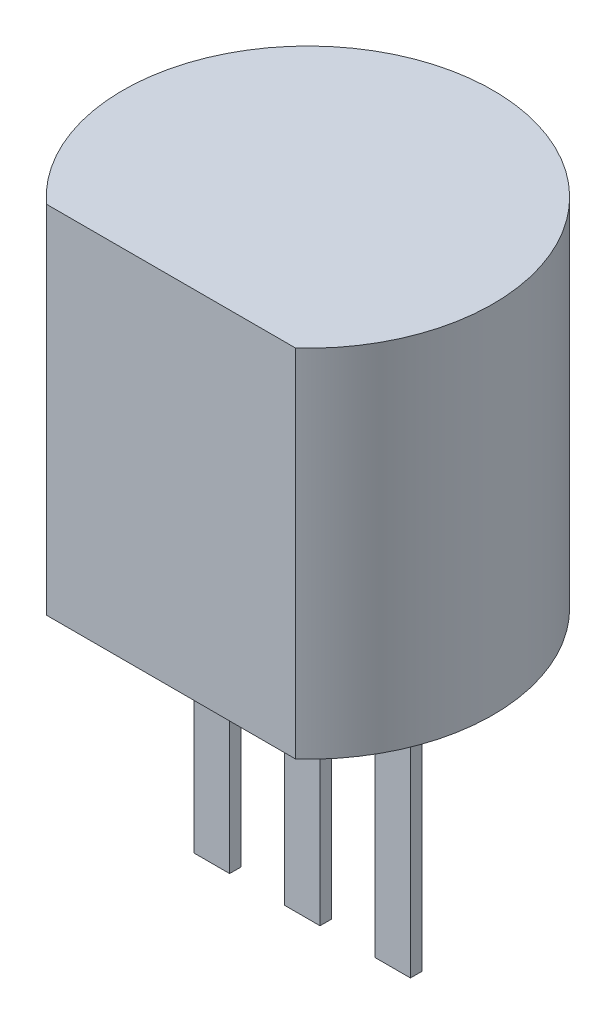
ISO-10303-21;
HEADER;
FILE_DESCRIPTION(('STEP AP214'),'2;1');
FILE_NAME('part.step','',(''),(''),'','','');
FILE_SCHEMA(('AUTOMOTIVE_DESIGN { 1 0 10303 214 1 1 1 1 }'));
ENDSEC;
DATA;
#1=APPLICATION_CONTEXT('core data for automotive mechanical design processes');
#2=APPLICATION_PROTOCOL_DEFINITION('international standard','automotive_design',2000,#1);
#3=PRODUCT_CONTEXT('',#1,'mechanical');
#4=PRODUCT('Part','Part','',(#3));
#5=PRODUCT_RELATED_PRODUCT_CATEGORY('part','',(#4));
#6=PRODUCT_DEFINITION_FORMATION('','',#4);
#7=PRODUCT_DEFINITION_CONTEXT('part definition',#1,'design');
#8=PRODUCT_DEFINITION('design','',#6,#7);
#9=PRODUCT_DEFINITION_SHAPE('','',#8);
#10=(LENGTH_UNIT() NAMED_UNIT(*) SI_UNIT(.MILLI.,.METRE.));
#11=(NAMED_UNIT(*) PLANE_ANGLE_UNIT() SI_UNIT($,.RADIAN.));
#12=(NAMED_UNIT(*) SI_UNIT($,.STERADIAN.) SOLID_ANGLE_UNIT());
#13=UNCERTAINTY_MEASURE_WITH_UNIT(LENGTH_MEASURE(1.E-05),#10,'distance_accuracy_value','');
#14=(GEOMETRIC_REPRESENTATION_CONTEXT(3) GLOBAL_UNCERTAINTY_ASSIGNED_CONTEXT((#13)) GLOBAL_UNIT_ASSIGNED_CONTEXT((#10,
#11,#12)) REPRESENTATION_CONTEXT('',''));
#15=CARTESIAN_POINT('',(0.,0.,0.));
#16=DIRECTION('',(0.,0.,1.));
#17=DIRECTION('',(1.,0.,0.));
#18=AXIS2_PLACEMENT_3D('',#15,#16,#17);
#19=CARTESIAN_POINT('',(0.,1.5,0.));
#20=DIRECTION('',(0.,1.,0.));
#21=DIRECTION('',(0.,0.,1.));
#22=AXIS2_PLACEMENT_3D('',#19,#20,#21);
#23=PLANE('',#22);
#24=DIRECTION('',(0.,0.,1.));
#25=VECTOR('',#24,1.);
#26=CARTESIAN_POINT('',(0.25,1.5,-0.0799999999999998));
#27=LINE('',#26,#25);
#28=CARTESIAN_POINT('',(0.25,1.5,-0.0799999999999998));
#29=VERTEX_POINT('',#28);
#30=CARTESIAN_POINT('',(0.25,1.5,0.08));
#31=VERTEX_POINT('',#30);
#32=EDGE_CURVE('E153',#29,#31,#27,.T.);
#33=ORIENTED_EDGE('',*,*,#32,.F.);
#34=DIRECTION('',(1.,0.,0.));
#35=VECTOR('',#34,1.);
#36=CARTESIAN_POINT('',(-0.25,1.5,-0.0799999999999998));
#37=LINE('',#36,#35);
#38=CARTESIAN_POINT('',(-0.25,1.5,-0.0799999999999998));
#39=VERTEX_POINT('',#38);
#40=EDGE_CURVE('E166',#39,#29,#37,.T.);
#41=ORIENTED_EDGE('',*,*,#40,.F.);
#42=DIRECTION('',(0.,0.,-1.));
#43=VECTOR('',#42,1.);
#44=CARTESIAN_POINT('',(-0.25,1.5,-0.0799999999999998));
#45=LINE('',#44,#43);
#46=CARTESIAN_POINT('',(-0.25,1.5,0.08));
#47=VERTEX_POINT('',#46);
#48=EDGE_CURVE('E175',#47,#39,#45,.T.);
#49=ORIENTED_EDGE('',*,*,#48,.F.);
#50=DIRECTION('',(-1.,0.,0.));
#51=VECTOR('',#50,1.);
#52=CARTESIAN_POINT('',(-0.25,1.5,0.08));
#53=LINE('',#52,#51);
#54=EDGE_CURVE('E156',#31,#47,#53,.T.);
#55=ORIENTED_EDGE('',*,*,#54,.F.);
#56=EDGE_LOOP('',(#33,#41,#49,#55));
#57=FACE_BOUND('',#56,.T.);
#58=CARTESIAN_POINT('',(0.,1.5,0.));
#59=DIRECTION('',(0.,1.,0.));
#60=DIRECTION('',(0.,0.,1.));
#61=AXIS2_PLACEMENT_3D('',#58,#59,#60);
#62=CIRCLE('',#61,2.6);
#63=CARTESIAN_POINT('',(1.75,1.5,1.92288845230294));
#64=VERTEX_POINT('',#63);
#65=CARTESIAN_POINT('',(-1.75,1.5,1.92288845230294));
#66=VERTEX_POINT('',#65);
#67=EDGE_CURVE('E224',#64,#66,#62,.T.);
#68=ORIENTED_EDGE('',*,*,#67,.F.);
#69=DIRECTION('',(1.,0.,0.));
#70=VECTOR('',#69,1.);
#71=CARTESIAN_POINT('',(-1.75,1.5,1.92288845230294));
#72=LINE('',#71,#70);
#73=EDGE_CURVE('E229',#66,#64,#72,.T.);
#74=ORIENTED_EDGE('',*,*,#73,.F.);
#75=EDGE_LOOP('',(#68,#74));
#76=FACE_BOUND('',#75,.T.);
#77=DIRECTION('',(0.,0.,1.));
#78=VECTOR('',#77,1.);
#79=CARTESIAN_POINT('',(-1.02,1.5,-0.08));
#80=LINE('',#79,#78);
#81=CARTESIAN_POINT('',(-1.02,1.5,-0.08));
#82=VERTEX_POINT('',#81);
#83=CARTESIAN_POINT('',(-1.02,1.5,0.08));
#84=VERTEX_POINT('',#83);
#85=EDGE_CURVE('E191',#82,#84,#80,.T.);
#86=ORIENTED_EDGE('',*,*,#85,.F.);
#87=DIRECTION('',(1.,0.,0.));
#88=VECTOR('',#87,1.);
#89=CARTESIAN_POINT('',(-1.52,1.5,-0.08));
#90=LINE('',#89,#88);
#91=CARTESIAN_POINT('',(-1.52,1.5,-0.08));
#92=VERTEX_POINT('',#91);
#93=EDGE_CURVE('E196',#92,#82,#90,.T.);
#94=ORIENTED_EDGE('',*,*,#93,.F.);
#95=DIRECTION('',(0.,0.,-1.));
#96=VECTOR('',#95,1.);
#97=CARTESIAN_POINT('',(-1.52,1.5,-0.08));
#98=LINE('',#97,#96);
#99=CARTESIAN_POINT('',(-1.52,1.5,0.08));
#100=VERTEX_POINT('',#99);
#101=EDGE_CURVE('E208',#100,#92,#98,.T.);
#102=ORIENTED_EDGE('',*,*,#101,.F.);
#103=DIRECTION('',(-1.,0.,0.));
#104=VECTOR('',#103,1.);
#105=CARTESIAN_POINT('',(-1.52,1.5,0.08));
#106=LINE('',#105,#104);
#107=EDGE_CURVE('E205',#84,#100,#106,.T.);
#108=ORIENTED_EDGE('',*,*,#107,.F.);
#109=EDGE_LOOP('',(#86,#94,#102,#108));
#110=FACE_BOUND('',#109,.T.);
#111=DIRECTION('',(0.,0.,1.));
#112=VECTOR('',#111,1.);
#113=CARTESIAN_POINT('',(1.52,1.5,-0.08));
#114=LINE('',#113,#112);
#115=CARTESIAN_POINT('',(1.52,1.5,-0.08));
#116=VERTEX_POINT('',#115);
#117=CARTESIAN_POINT('',(1.52,1.5,0.08));
#118=VERTEX_POINT('',#117);
#119=EDGE_CURVE('E152',#116,#118,#114,.T.);
#120=ORIENTED_EDGE('',*,*,#119,.F.);
#121=DIRECTION('',(1.,0.,0.));
#122=VECTOR('',#121,1.);
#123=CARTESIAN_POINT('',(1.02,1.5,-0.08));
#124=LINE('',#123,#122);
#125=CARTESIAN_POINT('',(1.02,1.5,-0.08));
#126=VERTEX_POINT('',#125);
#127=EDGE_CURVE('E149',#126,#116,#124,.T.);
#128=ORIENTED_EDGE('',*,*,#127,.F.);
#129=DIRECTION('',(0.,0.,-1.));
#130=VECTOR('',#129,1.);
#131=CARTESIAN_POINT('',(1.02,1.5,-0.08));
#132=LINE('',#131,#130);
#133=CARTESIAN_POINT('',(1.02,1.5,0.08));
#134=VERTEX_POINT('',#133);
#135=EDGE_CURVE('E51',#134,#126,#132,.T.);
#136=ORIENTED_EDGE('',*,*,#135,.F.);
#137=DIRECTION('',(-1.,0.,0.));
#138=VECTOR('',#137,1.);
#139=CARTESIAN_POINT('',(1.02,1.5,0.08));
#140=LINE('',#139,#138);
#141=EDGE_CURVE('E46',#118,#134,#140,.T.);
#142=ORIENTED_EDGE('',*,*,#141,.F.);
#143=EDGE_LOOP('',(#120,#128,#136,#142));
#144=FACE_BOUND('',#143,.T.);
#145=ADVANCED_FACE('F31',(#57,#76,#110,#144),#23,.F.);
#146=CARTESIAN_POINT('',(0.,6.5,0.));
#147=DIRECTION('',(0.,-1.,0.));
#148=DIRECTION('',(0.,0.,-1.));
#149=AXIS2_PLACEMENT_3D('',#146,#147,#148);
#150=CYLINDRICAL_SURFACE('',#149,2.6);
#151=ORIENTED_EDGE('',*,*,#67,.T.);
#152=DIRECTION('',(0.,-1.,0.));
#153=VECTOR('',#152,1.);
#154=CARTESIAN_POINT('',(-1.75,6.5,1.92288845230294));
#155=LINE('',#154,#153);
#156=CARTESIAN_POINT('',(-1.75,6.5,1.92288845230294));
#157=VERTEX_POINT('',#156);
#158=EDGE_CURVE('E11',#157,#66,#155,.T.);
#159=ORIENTED_EDGE('',*,*,#158,.F.);
#160=CARTESIAN_POINT('',(0.,6.5,0.));
#161=DIRECTION('',(0.,1.,0.));
#162=DIRECTION('',(0.,0.,1.));
#163=AXIS2_PLACEMENT_3D('',#160,#161,#162);
#164=CIRCLE('',#163,2.6);
#165=CARTESIAN_POINT('',(1.75,6.5,1.92288845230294));
#166=VERTEX_POINT('',#165);
#167=EDGE_CURVE('E225',#166,#157,#164,.T.);
#168=ORIENTED_EDGE('',*,*,#167,.F.);
#169=DIRECTION('',(0.,-1.,0.));
#170=VECTOR('',#169,1.);
#171=CARTESIAN_POINT('',(1.75,6.5,1.92288845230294));
#172=LINE('',#171,#170);
#173=EDGE_CURVE('E39',#166,#64,#172,.T.);
#174=ORIENTED_EDGE('',*,*,#173,.T.);
#175=EDGE_LOOP('',(#151,#159,#168,#174));
#176=FACE_BOUND('',#175,.T.);
#177=ADVANCED_FACE('F33',(#176),#150,.T.);
#178=CARTESIAN_POINT('',(-1.75,6.5,1.92288845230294));
#179=DIRECTION('',(0.,0.,-1.));
#180=DIRECTION('',(-1.,0.,0.));
#181=AXIS2_PLACEMENT_3D('',#178,#179,#180);
#182=PLANE('',#181);
#183=ORIENTED_EDGE('',*,*,#73,.T.);
#184=ORIENTED_EDGE('',*,*,#173,.F.);
#185=DIRECTION('',(1.,0.,0.));
#186=VECTOR('',#185,1.);
#187=CARTESIAN_POINT('',(-1.75,6.5,1.92288845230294));
#188=LINE('',#187,#186);
#189=EDGE_CURVE('E228',#157,#166,#188,.T.);
#190=ORIENTED_EDGE('',*,*,#189,.F.);
#191=ORIENTED_EDGE('',*,*,#158,.T.);
#192=EDGE_LOOP('',(#183,#184,#190,#191));
#193=FACE_BOUND('',#192,.T.);
#194=ADVANCED_FACE('F242',(#193),#182,.F.);
#195=CARTESIAN_POINT('',(0.,6.5,0.));
#196=DIRECTION('',(0.,1.,0.));
#197=DIRECTION('',(0.,0.,1.));
#198=AXIS2_PLACEMENT_3D('',#195,#196,#197);
#199=PLANE('',#198);
#200=ORIENTED_EDGE('',*,*,#167,.T.);
#201=ORIENTED_EDGE('',*,*,#189,.T.);
#202=EDGE_LOOP('',(#200,#201));
#203=FACE_BOUND('',#202,.T.);
#204=ADVANCED_FACE('F244',(#203),#199,.T.);
#205=CARTESIAN_POINT('',(-1.02,-2.2,-0.08));
#206=DIRECTION('',(-1.,0.,0.));
#207=DIRECTION('',(0.,0.,1.));
#208=AXIS2_PLACEMENT_3D('',#205,#206,#207);
#209=PLANE('',#208);
#210=ORIENTED_EDGE('',*,*,#85,.T.);
#211=DIRECTION('',(0.,1.,0.));
#212=VECTOR('',#211,1.);
#213=CARTESIAN_POINT('',(-1.02,-2.2,0.08));
#214=LINE('',#213,#212);
#215=CARTESIAN_POINT('',(-1.02,-2.2,0.08));
#216=VERTEX_POINT('',#215);
#217=EDGE_CURVE('E221',#216,#84,#214,.T.);
#218=ORIENTED_EDGE('',*,*,#217,.F.);
#219=DIRECTION('',(0.,0.,1.));
#220=VECTOR('',#219,1.);
#221=CARTESIAN_POINT('',(-1.02,-2.2,-0.08));
#222=LINE('',#221,#220);
#223=CARTESIAN_POINT('',(-1.02,-2.2,-0.08));
#224=VERTEX_POINT('',#223);
#225=EDGE_CURVE('E192',#224,#216,#222,.T.);
#226=ORIENTED_EDGE('',*,*,#225,.F.);
#227=DIRECTION('',(0.,1.,0.));
#228=VECTOR('',#227,1.);
#229=CARTESIAN_POINT('',(-1.02,-2.2,-0.08));
#230=LINE('',#229,#228);
#231=EDGE_CURVE('E202',#224,#82,#230,.T.);
#232=ORIENTED_EDGE('',*,*,#231,.T.);
#233=EDGE_LOOP('',(#210,#218,#226,#232));
#234=FACE_BOUND('',#233,.T.);
#235=ADVANCED_FACE('F246',(#234),#209,.F.);
#236=CARTESIAN_POINT('',(-1.52,-2.2,0.08));
#237=DIRECTION('',(0.,0.,-1.));
#238=DIRECTION('',(-1.,0.,0.));
#239=AXIS2_PLACEMENT_3D('',#236,#237,#238);
#240=PLANE('',#239);
#241=ORIENTED_EDGE('',*,*,#107,.T.);
#242=DIRECTION('',(0.,1.,0.));
#243=VECTOR('',#242,1.);
#244=CARTESIAN_POINT('',(-1.52,-2.2,0.08));
#245=LINE('',#244,#243);
#246=CARTESIAN_POINT('',(-1.52,-2.2,0.08));
#247=VERTEX_POINT('',#246);
#248=EDGE_CURVE('E218',#247,#100,#245,.T.);
#249=ORIENTED_EDGE('',*,*,#248,.F.);
#250=DIRECTION('',(-1.,0.,0.));
#251=VECTOR('',#250,1.);
#252=CARTESIAN_POINT('',(-1.52,-2.2,0.08));
#253=LINE('',#252,#251);
#254=EDGE_CURVE('E195',#216,#247,#253,.T.);
#255=ORIENTED_EDGE('',*,*,#254,.F.);
#256=ORIENTED_EDGE('',*,*,#217,.T.);
#257=EDGE_LOOP('',(#241,#249,#255,#256));
#258=FACE_BOUND('',#257,.T.);
#259=ADVANCED_FACE('F252',(#258),#240,.F.);
#260=CARTESIAN_POINT('',(-1.52,-2.2,-0.08));
#261=DIRECTION('',(1.,0.,0.));
#262=DIRECTION('',(0.,0.,-1.));
#263=AXIS2_PLACEMENT_3D('',#260,#261,#262);
#264=PLANE('',#263);
#265=ORIENTED_EDGE('',*,*,#101,.T.);
#266=DIRECTION('',(0.,1.,0.));
#267=VECTOR('',#266,1.);
#268=CARTESIAN_POINT('',(-1.52,-2.2,-0.08));
#269=LINE('',#268,#267);
#270=CARTESIAN_POINT('',(-1.52,-2.2,-0.08));
#271=VERTEX_POINT('',#270);
#272=EDGE_CURVE('E215',#271,#92,#269,.T.);
#273=ORIENTED_EDGE('',*,*,#272,.F.);
#274=DIRECTION('',(0.,0.,-1.));
#275=VECTOR('',#274,1.);
#276=CARTESIAN_POINT('',(-1.52,-2.2,-0.08));
#277=LINE('',#276,#275);
#278=EDGE_CURVE('E198',#247,#271,#277,.T.);
#279=ORIENTED_EDGE('',*,*,#278,.F.);
#280=ORIENTED_EDGE('',*,*,#248,.T.);
#281=EDGE_LOOP('',(#265,#273,#279,#280));
#282=FACE_BOUND('',#281,.T.);
#283=ADVANCED_FACE('F295',(#282),#264,.F.);
#284=CARTESIAN_POINT('',(-1.52,-2.2,-0.08));
#285=DIRECTION('',(0.,0.,1.));
#286=DIRECTION('',(1.,0.,0.));
#287=AXIS2_PLACEMENT_3D('',#284,#285,#286);
#288=PLANE('',#287);
#289=ORIENTED_EDGE('',*,*,#93,.T.);
#290=ORIENTED_EDGE('',*,*,#231,.F.);
#291=DIRECTION('',(1.,0.,0.));
#292=VECTOR('',#291,1.);
#293=CARTESIAN_POINT('',(-1.52,-2.2,-0.08));
#294=LINE('',#293,#292);
#295=EDGE_CURVE('E200',#271,#224,#294,.T.);
#296=ORIENTED_EDGE('',*,*,#295,.F.);
#297=ORIENTED_EDGE('',*,*,#272,.T.);
#298=EDGE_LOOP('',(#289,#290,#296,#297));
#299=FACE_BOUND('',#298,.T.);
#300=ADVANCED_FACE('F291',(#299),#288,.F.);
#301=CARTESIAN_POINT('',(-1.02,-2.2,0.08));
#302=DIRECTION('',(0.,1.,0.));
#303=DIRECTION('',(0.,0.,1.));
#304=AXIS2_PLACEMENT_3D('',#301,#302,#303);
#305=PLANE('',#304);
#306=ORIENTED_EDGE('',*,*,#225,.T.);
#307=ORIENTED_EDGE('',*,*,#254,.T.);
#308=ORIENTED_EDGE('',*,*,#278,.T.);
#309=ORIENTED_EDGE('',*,*,#295,.T.);
#310=EDGE_LOOP('',(#306,#307,#308,#309));
#311=FACE_BOUND('',#310,.T.);
#312=ADVANCED_FACE('F285',(#311),#305,.F.);
#313=CARTESIAN_POINT('',(0.25,-2.2,-0.0799999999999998));
#314=DIRECTION('',(-1.,0.,0.));
#315=DIRECTION('',(0.,0.,1.));
#316=AXIS2_PLACEMENT_3D('',#313,#314,#315);
#317=PLANE('',#316);
#318=ORIENTED_EDGE('',*,*,#32,.T.);
#319=DIRECTION('',(0.,1.,0.));
#320=VECTOR('',#319,1.);
#321=CARTESIAN_POINT('',(0.25,-2.2,0.08));
#322=LINE('',#321,#320);
#323=CARTESIAN_POINT('',(0.25,-2.2,0.08));
#324=VERTEX_POINT('',#323);
#325=EDGE_CURVE('E188',#324,#31,#322,.T.);
#326=ORIENTED_EDGE('',*,*,#325,.F.);
#327=DIRECTION('',(0.,0.,1.));
#328=VECTOR('',#327,1.);
#329=CARTESIAN_POINT('',(0.25,-2.2,-0.0799999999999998));
#330=LINE('',#329,#328);
#331=CARTESIAN_POINT('',(0.25,-2.2,-0.0799999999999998));
#332=VERTEX_POINT('',#331);
#333=EDGE_CURVE('E162',#332,#324,#330,.T.);
#334=ORIENTED_EDGE('',*,*,#333,.F.);
#335=DIRECTION('',(0.,1.,0.));
#336=VECTOR('',#335,1.);
#337=CARTESIAN_POINT('',(0.25,-2.2,-0.0799999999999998));
#338=LINE('',#337,#336);
#339=EDGE_CURVE('E171',#332,#29,#338,.T.);
#340=ORIENTED_EDGE('',*,*,#339,.T.);
#341=EDGE_LOOP('',(#318,#326,#334,#340));
#342=FACE_BOUND('',#341,.T.);
#343=ADVANCED_FACE('F269',(#342),#317,.F.);
#344=CARTESIAN_POINT('',(-0.25,-2.2,0.08));
#345=DIRECTION('',(0.,0.,-1.));
#346=DIRECTION('',(-1.,0.,0.));
#347=AXIS2_PLACEMENT_3D('',#344,#345,#346);
#348=PLANE('',#347);
#349=ORIENTED_EDGE('',*,*,#54,.T.);
#350=DIRECTION('',(0.,1.,0.));
#351=VECTOR('',#350,1.);
#352=CARTESIAN_POINT('',(-0.25,-2.2,0.08));
#353=LINE('',#352,#351);
#354=CARTESIAN_POINT('',(-0.25,-2.2,0.08));
#355=VERTEX_POINT('',#354);
#356=EDGE_CURVE('E185',#355,#47,#353,.T.);
#357=ORIENTED_EDGE('',*,*,#356,.F.);
#358=DIRECTION('',(-1.,0.,0.));
#359=VECTOR('',#358,1.);
#360=CARTESIAN_POINT('',(-0.25,-2.2,0.08));
#361=LINE('',#360,#359);
#362=EDGE_CURVE('E165',#324,#355,#361,.T.);
#363=ORIENTED_EDGE('',*,*,#362,.F.);
#364=ORIENTED_EDGE('',*,*,#325,.T.);
#365=EDGE_LOOP('',(#349,#357,#363,#364));
#366=FACE_BOUND('',#365,.T.);
#367=ADVANCED_FACE('F277',(#366),#348,.F.);
#368=CARTESIAN_POINT('',(-0.25,-2.2,-0.0799999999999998));
#369=DIRECTION('',(1.,0.,0.));
#370=DIRECTION('',(0.,0.,-1.));
#371=AXIS2_PLACEMENT_3D('',#368,#369,#370);
#372=PLANE('',#371);
#373=ORIENTED_EDGE('',*,*,#48,.T.);
#374=DIRECTION('',(0.,1.,0.));
#375=VECTOR('',#374,1.);
#376=CARTESIAN_POINT('',(-0.25,-2.2,-0.0799999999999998));
#377=LINE('',#376,#375);
#378=CARTESIAN_POINT('',(-0.25,-2.2,-0.0799999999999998));
#379=VERTEX_POINT('',#378);
#380=EDGE_CURVE('E182',#379,#39,#377,.T.);
#381=ORIENTED_EDGE('',*,*,#380,.F.);
#382=DIRECTION('',(0.,0.,-1.));
#383=VECTOR('',#382,1.);
#384=CARTESIAN_POINT('',(-0.25,-2.2,-0.0799999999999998));
#385=LINE('',#384,#383);
#386=EDGE_CURVE('E168',#355,#379,#385,.T.);
#387=ORIENTED_EDGE('',*,*,#386,.F.);
#388=ORIENTED_EDGE('',*,*,#356,.T.);
#389=EDGE_LOOP('',(#373,#381,#387,#388));
#390=FACE_BOUND('',#389,.T.);
#391=ADVANCED_FACE('F275',(#390),#372,.F.);
#392=CARTESIAN_POINT('',(-0.25,-2.2,-0.0799999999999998));
#393=DIRECTION('',(0.,0.,1.));
#394=DIRECTION('',(1.,0.,0.));
#395=AXIS2_PLACEMENT_3D('',#392,#393,#394);
#396=PLANE('',#395);
#397=ORIENTED_EDGE('',*,*,#40,.T.);
#398=ORIENTED_EDGE('',*,*,#339,.F.);
#399=DIRECTION('',(1.,0.,0.));
#400=VECTOR('',#399,1.);
#401=CARTESIAN_POINT('',(-0.25,-2.2,-0.0799999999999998));
#402=LINE('',#401,#400);
#403=EDGE_CURVE('E170',#379,#332,#402,.T.);
#404=ORIENTED_EDGE('',*,*,#403,.F.);
#405=ORIENTED_EDGE('',*,*,#380,.T.);
#406=EDGE_LOOP('',(#397,#398,#404,#405));
#407=FACE_BOUND('',#406,.T.);
#408=ADVANCED_FACE('F265',(#407),#396,.F.);
#409=CARTESIAN_POINT('',(0.25,-2.2,0.08));
#410=DIRECTION('',(0.,1.,0.));
#411=DIRECTION('',(0.,0.,1.));
#412=AXIS2_PLACEMENT_3D('',#409,#410,#411);
#413=PLANE('',#412);
#414=ORIENTED_EDGE('',*,*,#333,.T.);
#415=ORIENTED_EDGE('',*,*,#362,.T.);
#416=ORIENTED_EDGE('',*,*,#386,.T.);
#417=ORIENTED_EDGE('',*,*,#403,.T.);
#418=EDGE_LOOP('',(#414,#415,#416,#417));
#419=FACE_BOUND('',#418,.T.);
#420=ADVANCED_FACE('F271',(#419),#413,.F.);
#421=CARTESIAN_POINT('',(1.52,-2.2,-0.08));
#422=DIRECTION('',(-1.,0.,0.));
#423=DIRECTION('',(0.,0.,1.));
#424=AXIS2_PLACEMENT_3D('',#421,#422,#423);
#425=PLANE('',#424);
#426=ORIENTED_EDGE('',*,*,#119,.T.);
#427=DIRECTION('',(0.,1.,0.));
#428=VECTOR('',#427,1.);
#429=CARTESIAN_POINT('',(1.52,-2.2,0.08));
#430=LINE('',#429,#428);
#431=CARTESIAN_POINT('',(1.52,-2.2,0.08));
#432=VERTEX_POINT('',#431);
#433=EDGE_CURVE('E133',#432,#118,#430,.T.);
#434=ORIENTED_EDGE('',*,*,#433,.F.);
#435=DIRECTION('',(0.,0.,1.));
#436=VECTOR('',#435,1.);
#437=CARTESIAN_POINT('',(1.52,-2.2,-0.08));
#438=LINE('',#437,#436);
#439=CARTESIAN_POINT('',(1.52,-2.2,-0.08));
#440=VERTEX_POINT('',#439);
#441=EDGE_CURVE('E140',#440,#432,#438,.T.);
#442=ORIENTED_EDGE('',*,*,#441,.F.);
#443=DIRECTION('',(0.,1.,0.));
#444=VECTOR('',#443,1.);
#445=CARTESIAN_POINT('',(1.52,-2.2,-0.08));
#446=LINE('',#445,#444);
#447=EDGE_CURVE('E316',#440,#116,#446,.T.);
#448=ORIENTED_EDGE('',*,*,#447,.T.);
#449=EDGE_LOOP('',(#426,#434,#442,#448));
#450=FACE_BOUND('',#449,.T.);
#451=ADVANCED_FACE('F151',(#450),#425,.F.);
#452=CARTESIAN_POINT('',(1.02,-2.2,0.08));
#453=DIRECTION('',(0.,0.,-1.));
#454=DIRECTION('',(-1.,0.,0.));
#455=AXIS2_PLACEMENT_3D('',#452,#453,#454);
#456=PLANE('',#455);
#457=ORIENTED_EDGE('',*,*,#141,.T.);
#458=DIRECTION('',(0.,1.,0.));
#459=VECTOR('',#458,1.);
#460=CARTESIAN_POINT('',(1.02,-2.2,0.08));
#461=LINE('',#460,#459);
#462=CARTESIAN_POINT('',(1.02,-2.2,0.08));
#463=VERTEX_POINT('',#462);
#464=EDGE_CURVE('E136',#463,#134,#461,.T.);
#465=ORIENTED_EDGE('',*,*,#464,.F.);
#466=DIRECTION('',(-1.,0.,0.));
#467=VECTOR('',#466,1.);
#468=CARTESIAN_POINT('',(1.02,-2.2,0.08));
#469=LINE('',#468,#467);
#470=EDGE_CURVE('E129',#432,#463,#469,.T.);
#471=ORIENTED_EDGE('',*,*,#470,.F.);
#472=ORIENTED_EDGE('',*,*,#433,.T.);
#473=EDGE_LOOP('',(#457,#465,#471,#472));
#474=FACE_BOUND('',#473,.T.);
#475=ADVANCED_FACE('F131',(#474),#456,.F.);
#476=CARTESIAN_POINT('',(1.02,-2.2,-0.08));
#477=DIRECTION('',(1.,0.,0.));
#478=DIRECTION('',(0.,0.,-1.));
#479=AXIS2_PLACEMENT_3D('',#476,#477,#478);
#480=PLANE('',#479);
#481=ORIENTED_EDGE('',*,*,#135,.T.);
#482=DIRECTION('',(0.,1.,0.));
#483=VECTOR('',#482,1.);
#484=CARTESIAN_POINT('',(1.02,-2.2,-0.08));
#485=LINE('',#484,#483);
#486=CARTESIAN_POINT('',(1.02,-2.2,-0.08));
#487=VERTEX_POINT('',#486);
#488=EDGE_CURVE('E158',#487,#126,#485,.T.);
#489=ORIENTED_EDGE('',*,*,#488,.F.);
#490=DIRECTION('',(0.,0.,-1.));
#491=VECTOR('',#490,1.);
#492=CARTESIAN_POINT('',(1.02,-2.2,-0.08));
#493=LINE('',#492,#491);
#494=EDGE_CURVE('E139',#463,#487,#493,.T.);
#495=ORIENTED_EDGE('',*,*,#494,.F.);
#496=ORIENTED_EDGE('',*,*,#464,.T.);
#497=EDGE_LOOP('',(#481,#489,#495,#496));
#498=FACE_BOUND('',#497,.T.);
#499=ADVANCED_FACE('F325',(#498),#480,.F.);
#500=CARTESIAN_POINT('',(1.02,-2.2,-0.08));
#501=DIRECTION('',(0.,0.,1.));
#502=DIRECTION('',(1.,0.,0.));
#503=AXIS2_PLACEMENT_3D('',#500,#501,#502);
#504=PLANE('',#503);
#505=ORIENTED_EDGE('',*,*,#127,.T.);
#506=ORIENTED_EDGE('',*,*,#447,.F.);
#507=DIRECTION('',(1.,0.,0.));
#508=VECTOR('',#507,1.);
#509=CARTESIAN_POINT('',(1.02,-2.2,-0.08));
#510=LINE('',#509,#508);
#511=EDGE_CURVE('E145',#487,#440,#510,.T.);
#512=ORIENTED_EDGE('',*,*,#511,.F.);
#513=ORIENTED_EDGE('',*,*,#488,.T.);
#514=EDGE_LOOP('',(#505,#506,#512,#513));
#515=FACE_BOUND('',#514,.T.);
#516=ADVANCED_FACE('F315',(#515),#504,.F.);
#517=CARTESIAN_POINT('',(1.52,-2.2,0.08));
#518=DIRECTION('',(0.,1.,0.));
#519=DIRECTION('',(0.,0.,1.));
#520=AXIS2_PLACEMENT_3D('',#517,#518,#519);
#521=PLANE('',#520);
#522=ORIENTED_EDGE('',*,*,#441,.T.);
#523=ORIENTED_EDGE('',*,*,#470,.T.);
#524=ORIENTED_EDGE('',*,*,#494,.T.);
#525=ORIENTED_EDGE('',*,*,#511,.T.);
#526=EDGE_LOOP('',(#522,#523,#524,#525));
#527=FACE_BOUND('',#526,.T.);
#528=ADVANCED_FACE('F143',(#527),#521,.F.);
#529=CLOSED_SHELL('',(#145,#177,#194,#204,#235,#259,#283,#300,#312,#343,#367,#391,#408,#420,
#451,#475,#499,#516,#528));
#530=MANIFOLD_SOLID_BREP('B2',#529);
#531=ADVANCED_BREP_SHAPE_REPRESENTATION('',(#18,#530),#14);
#532=SHAPE_DEFINITION_REPRESENTATION(#9,#531);
ENDSEC;
END-ISO-10303-21;
